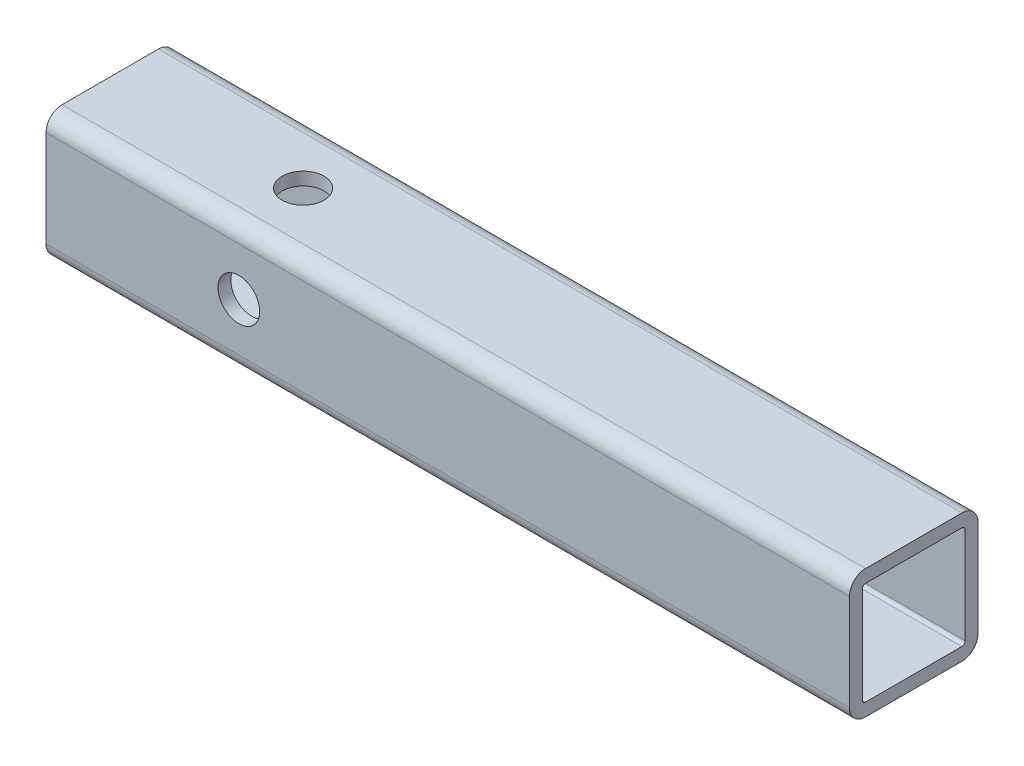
from build123d import *

# Parameters (mm, degrees)
BASE_EXTRUSION_DEPTH    = 250
ESQUISSE4_R             = 6.5
ENL_V_MAT_EXTRU_3_DEPTH = 257.32011236
ESQUISSE5_R             = 6.5
ENL_V_MAT_EXTRU_4_DEPTH = 257.32011236


with BuildPart() as part:
    # Esquisse1 → Base-Extrusion (new body)
    with BuildSketch(Plane(origin=(0, 0, 0), x_dir=(0, 0, -1), z_dir=(1, 0, 0))):
        with BuildLine():
            Line((-5, 0), (-35, 0))
            ThreePointArc((-35, 0), (-38.535533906, -1.464466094), (-40, -5))
            Line((-40, -5), (-40, -35))
            ThreePointArc((-40, -35), (-38.535533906, -38.535533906), (-35, -40))
            Line((-35, -40), (-5, -40))
            ThreePointArc((-5, -40), (-1.464466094, -38.535533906), (0, -35))
            Line((0, -35), (0, -5))
            ThreePointArc((0, -5), (-1.464466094, -1.464466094), (-5, 0))
        make_face()
        with BuildLine():
            Line((-4, -5), (-4, -35))
            ThreePointArc((-4, -35), (-4.292893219, -35.707106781), (-5, -36))
            Line((-5, -36), (-35, -36))
            ThreePointArc((-35, -36), (-35.707106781, -35.707106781), (-36, -35))
            Line((-36, -35), (-36, -5))
            ThreePointArc((-36, -5), (-35.707106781, -4.292893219), (-35, -4))
            Line((-35, -4), (-5, -4))
            ThreePointArc((-5, -4), (-4.292893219, -4.292893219), (-4, -5))
        make_face(mode=Mode.SUBTRACT)
    extrude(amount=BASE_EXTRUSION_DEPTH)

    # Esquisse4 → Enl_v. mat.-Extru.3 (cut, through all)
    with BuildSketch(Plane.XY.offset(40)):
        with Locations((60, -20)):
            Circle(ESQUISSE4_R)
    extrude(amount=-ENL_V_MAT_EXTRU_3_DEPTH, mode=Mode.SUBTRACT)

    # Esquisse5 → Enl_v. mat.-Extru.4 (cut, through all)
    with BuildSketch(Plane.XZ.offset(40)):
        with Locations(Location((60, 20, 0), (0, 0, 270))):
            Circle(ESQUISSE5_R)
    extrude(amount=-ENL_V_MAT_EXTRU_4_DEPTH, mode=Mode.SUBTRACT)


solid = part.part
